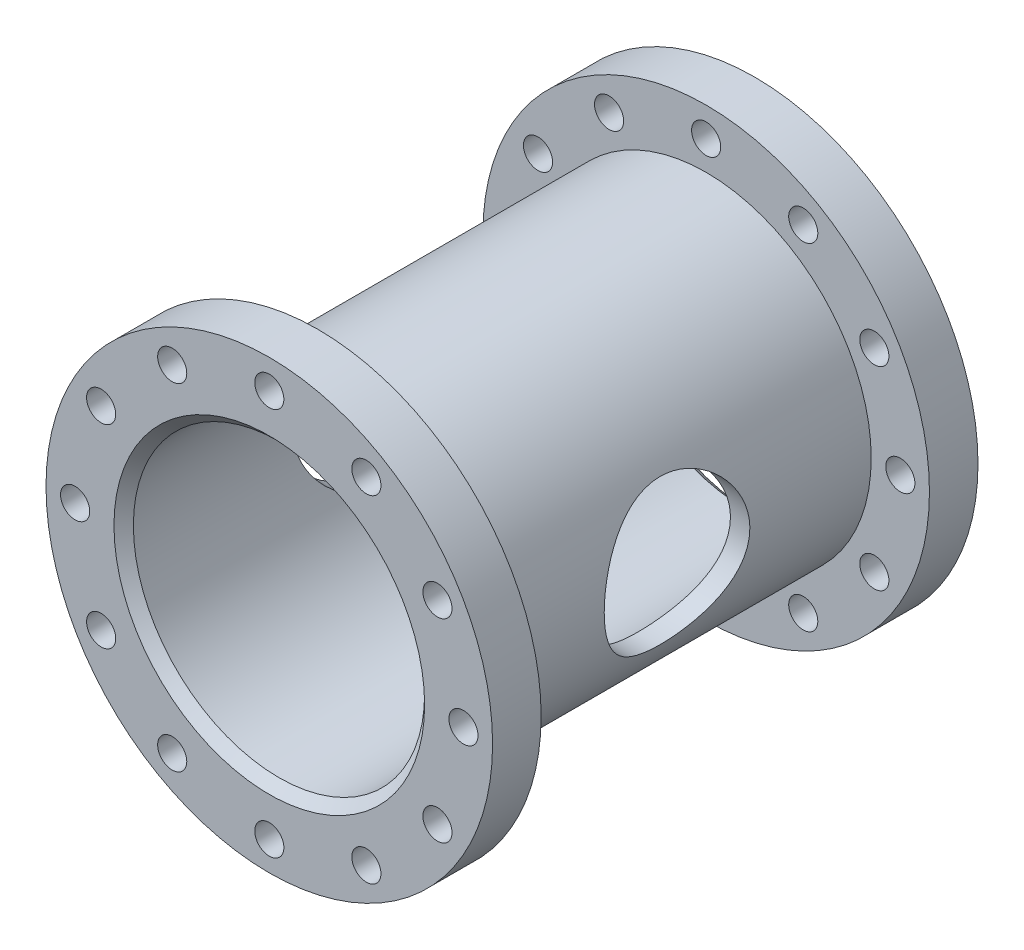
from build123d import *

# Parameters (mm, degrees)
SKETCH1_R                  = 85
SKETCH1_R_2                = 75
BOSS_EXTRUDE1_DEPTH        = 100
SKETCH2_R                  = 115
SKETCH2_R_2                = 75
BOSS_EXTRUDE2_DEPTH        = 25
F_15_0_15_DIAMETER_HOLE1_D = 15
CIRPATTERN1_COUNT          = 12
CHAMFER1_SIZE              = 5
CUT_EXTRUDE1_DEPTH         = 206.121914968
CUT_EXTRUDE1_DEPTH_BACK    = 206.121914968
SKETCH5_R                  = 37.5


with BuildPart() as part:
    # Sketch1 → Boss-Extrude1 (new body)
    with BuildSketch(Plane.XY):
        Circle(SKETCH1_R)
        Circle(SKETCH1_R_2, mode=Mode.SUBTRACT)
    extrude(amount=BOSS_EXTRUDE1_DEPTH)

    # Sketch2 → Boss-Extrude2 (add)
    with BuildSketch(Plane.XY.offset(100)):
        Circle(SKETCH2_R)
        Circle(SKETCH2_R_2, mode=Mode.SUBTRACT)
    extrude(amount=BOSS_EXTRUDE2_DEPTH)

    # 15.0 _15_ Diameter Hole1 (through all)
    with Locations(Plane.XY.offset(125)):
        with Locations((0, 100)):
            f_15_0_15_diameter_hole1 = Hole(F_15_0_15_DIAMETER_HOLE1_D / 2)

    # CirPattern1: 15.0 _15_ Diameter Hole1 ×12 about axis
    cirpattern1_axis = Axis((0, 0, 0), (0, 0, 1))
    for i in range(1, CIRPATTERN1_COUNT):
        add(f_15_0_15_diameter_hole1.rotate(cirpattern1_axis, i * 360 / CIRPATTERN1_COUNT), mode=Mode.SUBTRACT)

    # Chamfer1
    chamfer1_edges = [part.edges().sort_by_distance(p)[0] for p in [
        (-75, 0, 125),
    ]]
    chamfer(chamfer1_edges, length=CHAMFER1_SIZE)

    # Mirror1: part across plane


with BuildPart() as part_1:
    add(part.part)
    add(part.part.mirror(Plane.XY))

    # Sketch5 → Cut-Extrude1 (cut, two sides: drawn at the far end of the back side and taken through both)
    with BuildSketch(Plane(origin=(0, 0, 0), x_dir=(0, 0, -1), z_dir=(1, 0, 0)).offset(-CUT_EXTRUDE1_DEPTH_BACK)):
        Circle(SKETCH5_R)
    extrude(amount=CUT_EXTRUDE1_DEPTH + CUT_EXTRUDE1_DEPTH_BACK, mode=Mode.SUBTRACT)


solid = part_1.part
